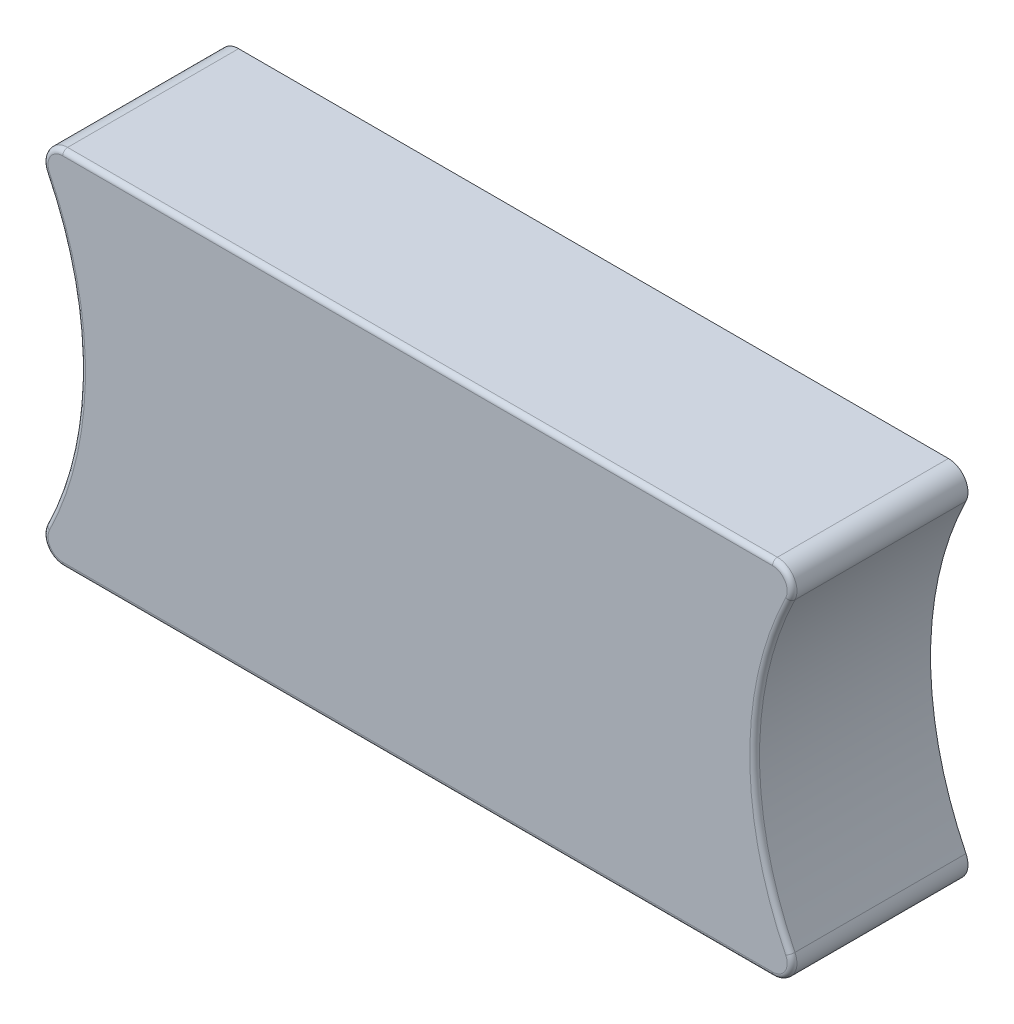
ISO-10303-21;
HEADER;
FILE_DESCRIPTION(('STEP AP214'),'2;1');
FILE_NAME('part.step','',(''),(''),'','','');
FILE_SCHEMA(('AUTOMOTIVE_DESIGN { 1 0 10303 214 1 1 1 1 }'));
ENDSEC;
DATA;
#1=APPLICATION_CONTEXT('core data for automotive mechanical design processes');
#2=APPLICATION_PROTOCOL_DEFINITION('international standard','automotive_design',2000,#1);
#3=PRODUCT_CONTEXT('',#1,'mechanical');
#4=PRODUCT('Part','Part','',(#3));
#5=PRODUCT_RELATED_PRODUCT_CATEGORY('part','',(#4));
#6=PRODUCT_DEFINITION_FORMATION('','',#4);
#7=PRODUCT_DEFINITION_CONTEXT('part definition',#1,'design');
#8=PRODUCT_DEFINITION('design','',#6,#7);
#9=PRODUCT_DEFINITION_SHAPE('','',#8);
#10=(LENGTH_UNIT() NAMED_UNIT(*) SI_UNIT(.MILLI.,.METRE.));
#11=(NAMED_UNIT(*) PLANE_ANGLE_UNIT() SI_UNIT($,.RADIAN.));
#12=(NAMED_UNIT(*) SI_UNIT($,.STERADIAN.) SOLID_ANGLE_UNIT());
#13=UNCERTAINTY_MEASURE_WITH_UNIT(LENGTH_MEASURE(1.E-05),#10,'distance_accuracy_value','');
#14=(GEOMETRIC_REPRESENTATION_CONTEXT(3) GLOBAL_UNCERTAINTY_ASSIGNED_CONTEXT((#13)) GLOBAL_UNIT_ASSIGNED_CONTEXT((#10,
#11,#12)) REPRESENTATION_CONTEXT('',''));
#15=CARTESIAN_POINT('',(0.,0.,0.));
#16=DIRECTION('',(0.,0.,1.));
#17=DIRECTION('',(1.,0.,0.));
#18=AXIS2_PLACEMENT_3D('',#15,#16,#17);
#19=CARTESIAN_POINT('',(72.6340015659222,37.,3.));
#20=DIRECTION('',(0.,-1.,0.));
#21=DIRECTION('',(0.,0.,-1.));
#22=AXIS2_PLACEMENT_3D('',#19,#20,#21);
#23=PLANE('',#22);
#24=DIRECTION('',(0.,0.,-1.));
#25=VECTOR('',#24,1.);
#26=CARTESIAN_POINT('',(-72.6340015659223,37.,3.));
#27=LINE('',#26,#25);
#28=CARTESIAN_POINT('',(-72.6340015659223,37.,2.));
#29=VERTEX_POINT('',#28);
#30=CARTESIAN_POINT('',(-72.6340015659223,37.,-33.));
#31=VERTEX_POINT('',#30);
#32=EDGE_CURVE('E289',#29,#31,#27,.T.);
#33=ORIENTED_EDGE('',*,*,#32,.F.);
#34=DIRECTION('',(-1.,0.,0.));
#35=VECTOR('',#34,1.);
#36=CARTESIAN_POINT('',(72.6340015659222,37.,2.));
#37=LINE('',#36,#35);
#38=CARTESIAN_POINT('',(72.6340015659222,37.,2.));
#39=VERTEX_POINT('',#38);
#40=EDGE_CURVE('E11',#29,#39,#37,.F.);
#41=ORIENTED_EDGE('',*,*,#40,.T.);
#42=DIRECTION('',(0.,0.,-1.));
#43=VECTOR('',#42,1.);
#44=CARTESIAN_POINT('',(72.6340015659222,37.,3.));
#45=LINE('',#44,#43);
#46=CARTESIAN_POINT('',(72.6340015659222,37.,-33.));
#47=VERTEX_POINT('',#46);
#48=EDGE_CURVE('E275',#39,#47,#45,.T.);
#49=ORIENTED_EDGE('',*,*,#48,.T.);
#50=DIRECTION('',(-1.,0.,0.));
#51=VECTOR('',#50,1.);
#52=CARTESIAN_POINT('',(72.6340015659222,37.,-33.));
#53=LINE('',#52,#51);
#54=EDGE_CURVE('E205',#47,#31,#53,.T.);
#55=ORIENTED_EDGE('',*,*,#54,.T.);
#56=EDGE_LOOP('',(#33,#41,#49,#55));
#57=FACE_BOUND('',#56,.T.);
#58=ADVANCED_FACE('F41',(#57),#23,.F.);
#59=CARTESIAN_POINT('',(-72.6340015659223,33.,3.));
#60=DIRECTION('',(0.,0.,-1.));
#61=DIRECTION('',(-1.,0.,0.));
#62=AXIS2_PLACEMENT_3D('',#59,#60,#61);
#63=CYLINDRICAL_SURFACE('',#62,3.99999999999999);
#64=DIRECTION('',(0.,0.,-1.));
#65=VECTOR('',#64,1.);
#66=CARTESIAN_POINT('',(-76.2253313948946,31.2386510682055,3.));
#67=LINE('',#66,#65);
#68=CARTESIAN_POINT('',(-76.2253313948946,31.2386510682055,2.));
#69=VERTEX_POINT('',#68);
#70=CARTESIAN_POINT('',(-76.2253313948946,31.2386510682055,-33.));
#71=VERTEX_POINT('',#70);
#72=EDGE_CURVE('E287',#69,#71,#67,.T.);
#73=ORIENTED_EDGE('',*,*,#72,.F.);
#74=CARTESIAN_POINT('',(-72.6340015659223,33.,2.));
#75=DIRECTION('',(0.,0.,1.));
#76=DIRECTION('',(1.,0.,0.));
#77=AXIS2_PLACEMENT_3D('',#74,#75,#76);
#78=CIRCLE('',#77,3.99999999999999);
#79=EDGE_CURVE('E50',#69,#29,#78,.F.);
#80=ORIENTED_EDGE('',*,*,#79,.T.);
#81=ORIENTED_EDGE('',*,*,#32,.T.);
#82=CARTESIAN_POINT('',(-72.6340015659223,33.,-33.));
#83=DIRECTION('',(0.,0.,1.));
#84=DIRECTION('',(1.,0.,0.));
#85=AXIS2_PLACEMENT_3D('',#82,#83,#84);
#86=CIRCLE('',#85,3.99999999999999);
#87=EDGE_CURVE('E209',#31,#71,#86,.T.);
#88=ORIENTED_EDGE('',*,*,#87,.T.);
#89=EDGE_LOOP('',(#73,#80,#81,#88));
#90=FACE_BOUND('',#89,.T.);
#91=ADVANCED_FACE('F410',(#90),#63,.T.);
#92=CARTESIAN_POINT('',(-139.919865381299,0.,3.));
#93=DIRECTION('',(0.,0.,-1.));
#94=DIRECTION('',(-1.,0.,0.));
#95=AXIS2_PLACEMENT_3D('',#92,#93,#94);
#96=CYLINDRICAL_SURFACE('',#95,70.942561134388);
#97=DIRECTION('',(0.,0.,-1.));
#98=VECTOR('',#97,1.);
#99=CARTESIAN_POINT('',(-76.2253313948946,-31.2386510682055,3.));
#100=LINE('',#99,#98);
#101=CARTESIAN_POINT('',(-76.2253313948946,-31.2386510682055,2.));
#102=VERTEX_POINT('',#101);
#103=CARTESIAN_POINT('',(-76.2253313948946,-31.2386510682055,-33.));
#104=VERTEX_POINT('',#103);
#105=EDGE_CURVE('E285',#102,#104,#100,.T.);
#106=ORIENTED_EDGE('',*,*,#105,.F.);
#107=CARTESIAN_POINT('',(-139.919865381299,0.,2.));
#108=DIRECTION('',(0.,0.,1.));
#109=DIRECTION('',(1.,0.,0.));
#110=AXIS2_PLACEMENT_3D('',#107,#108,#109);
#111=CIRCLE('',#110,70.942561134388);
#112=EDGE_CURVE('E65',#102,#69,#111,.T.);
#113=ORIENTED_EDGE('',*,*,#112,.T.);
#114=ORIENTED_EDGE('',*,*,#72,.T.);
#115=CARTESIAN_POINT('',(-139.919865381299,0.,-33.));
#116=DIRECTION('',(0.,0.,1.));
#117=DIRECTION('',(1.,0.,0.));
#118=AXIS2_PLACEMENT_3D('',#115,#116,#117);
#119=CIRCLE('',#118,70.942561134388);
#120=EDGE_CURVE('E257',#104,#71,#119,.T.);
#121=ORIENTED_EDGE('',*,*,#120,.F.);
#122=EDGE_LOOP('',(#106,#113,#114,#121));
#123=FACE_BOUND('',#122,.T.);
#124=ADVANCED_FACE('F355',(#123),#96,.F.);
#125=CARTESIAN_POINT('',(-72.6340015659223,-33.,3.));
#126=DIRECTION('',(0.,0.,-1.));
#127=DIRECTION('',(-1.,0.,0.));
#128=AXIS2_PLACEMENT_3D('',#125,#126,#127);
#129=CYLINDRICAL_SURFACE('',#128,3.99999999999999);
#130=DIRECTION('',(0.,0.,-1.));
#131=VECTOR('',#130,1.);
#132=CARTESIAN_POINT('',(-72.6340015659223,-37.,3.));
#133=LINE('',#132,#131);
#134=CARTESIAN_POINT('',(-72.6340015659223,-37.,2.));
#135=VERTEX_POINT('',#134);
#136=CARTESIAN_POINT('',(-72.6340015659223,-37.,-33.));
#137=VERTEX_POINT('',#136);
#138=EDGE_CURVE('E283',#135,#137,#133,.T.);
#139=ORIENTED_EDGE('',*,*,#138,.F.);
#140=CARTESIAN_POINT('',(-72.6340015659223,-33.,2.));
#141=DIRECTION('',(0.,0.,1.));
#142=DIRECTION('',(1.,0.,0.));
#143=AXIS2_PLACEMENT_3D('',#140,#141,#142);
#144=CIRCLE('',#143,3.99999999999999);
#145=EDGE_CURVE('E317',#135,#102,#144,.F.);
#146=ORIENTED_EDGE('',*,*,#145,.T.);
#147=ORIENTED_EDGE('',*,*,#105,.T.);
#148=CARTESIAN_POINT('',(-72.6340015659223,-33.,-33.));
#149=DIRECTION('',(0.,0.,1.));
#150=DIRECTION('',(1.,0.,0.));
#151=AXIS2_PLACEMENT_3D('',#148,#149,#150);
#152=CIRCLE('',#151,3.99999999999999);
#153=EDGE_CURVE('E260',#104,#137,#152,.T.);
#154=ORIENTED_EDGE('',*,*,#153,.T.);
#155=EDGE_LOOP('',(#139,#146,#147,#154));
#156=FACE_BOUND('',#155,.T.);
#157=ADVANCED_FACE('F353',(#156),#129,.T.);
#158=CARTESIAN_POINT('',(-72.6340015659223,-37.,3.));
#159=DIRECTION('',(0.,1.,0.));
#160=DIRECTION('',(0.,0.,1.));
#161=AXIS2_PLACEMENT_3D('',#158,#159,#160);
#162=PLANE('',#161);
#163=DIRECTION('',(0.,0.,-1.));
#164=VECTOR('',#163,1.);
#165=CARTESIAN_POINT('',(72.6340015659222,-37.,3.));
#166=LINE('',#165,#164);
#167=CARTESIAN_POINT('',(72.6340015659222,-37.,2.));
#168=VERTEX_POINT('',#167);
#169=CARTESIAN_POINT('',(72.6340015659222,-37.,-33.));
#170=VERTEX_POINT('',#169);
#171=EDGE_CURVE('E281',#168,#170,#166,.T.);
#172=ORIENTED_EDGE('',*,*,#171,.F.);
#173=DIRECTION('',(1.,0.,0.));
#174=VECTOR('',#173,1.);
#175=CARTESIAN_POINT('',(-72.6340015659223,-37.,2.));
#176=LINE('',#175,#174);
#177=EDGE_CURVE('E315',#168,#135,#176,.F.);
#178=ORIENTED_EDGE('',*,*,#177,.T.);
#179=ORIENTED_EDGE('',*,*,#138,.T.);
#180=DIRECTION('',(1.,0.,0.));
#181=VECTOR('',#180,1.);
#182=CARTESIAN_POINT('',(-72.6340015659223,-37.,-33.));
#183=LINE('',#182,#181);
#184=EDGE_CURVE('E263',#137,#170,#183,.T.);
#185=ORIENTED_EDGE('',*,*,#184,.T.);
#186=EDGE_LOOP('',(#172,#178,#179,#185));
#187=FACE_BOUND('',#186,.T.);
#188=ADVANCED_FACE('F365',(#187),#162,.F.);
#189=CARTESIAN_POINT('',(72.6340015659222,-33.,3.));
#190=DIRECTION('',(0.,0.,-1.));
#191=DIRECTION('',(-1.,0.,0.));
#192=AXIS2_PLACEMENT_3D('',#189,#190,#191);
#193=CYLINDRICAL_SURFACE('',#192,4.);
#194=DIRECTION('',(0.,0.,-1.));
#195=VECTOR('',#194,1.);
#196=CARTESIAN_POINT('',(76.2253313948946,-31.2386510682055,3.));
#197=LINE('',#196,#195);
#198=CARTESIAN_POINT('',(76.2253313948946,-31.2386510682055,2.));
#199=VERTEX_POINT('',#198);
#200=CARTESIAN_POINT('',(76.2253313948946,-31.2386510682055,-33.));
#201=VERTEX_POINT('',#200);
#202=EDGE_CURVE('E279',#199,#201,#197,.T.);
#203=ORIENTED_EDGE('',*,*,#202,.F.);
#204=CARTESIAN_POINT('',(72.6340015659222,-33.,2.));
#205=DIRECTION('',(0.,0.,1.));
#206=DIRECTION('',(1.,0.,0.));
#207=AXIS2_PLACEMENT_3D('',#204,#205,#206);
#208=CIRCLE('',#207,4.);
#209=EDGE_CURVE('E313',#199,#168,#208,.F.);
#210=ORIENTED_EDGE('',*,*,#209,.T.);
#211=ORIENTED_EDGE('',*,*,#171,.T.);
#212=CARTESIAN_POINT('',(72.6340015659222,-33.,-33.));
#213=DIRECTION('',(0.,0.,1.));
#214=DIRECTION('',(1.,0.,0.));
#215=AXIS2_PLACEMENT_3D('',#212,#213,#214);
#216=CIRCLE('',#215,4.);
#217=EDGE_CURVE('E266',#170,#201,#216,.T.);
#218=ORIENTED_EDGE('',*,*,#217,.T.);
#219=EDGE_LOOP('',(#203,#210,#211,#218));
#220=FACE_BOUND('',#219,.T.);
#221=ADVANCED_FACE('F368',(#220),#193,.T.);
#222=CARTESIAN_POINT('',(139.919865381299,0.,3.));
#223=DIRECTION('',(0.,0.,-1.));
#224=DIRECTION('',(-1.,0.,0.));
#225=AXIS2_PLACEMENT_3D('',#222,#223,#224);
#226=CYLINDRICAL_SURFACE('',#225,70.942561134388);
#227=DIRECTION('',(0.,0.,-1.));
#228=VECTOR('',#227,1.);
#229=CARTESIAN_POINT('',(76.2253313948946,31.2386510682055,3.));
#230=LINE('',#229,#228);
#231=CARTESIAN_POINT('',(76.2253313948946,31.2386510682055,2.));
#232=VERTEX_POINT('',#231);
#233=CARTESIAN_POINT('',(76.2253313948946,31.2386510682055,-33.));
#234=VERTEX_POINT('',#233);
#235=EDGE_CURVE('E277',#232,#234,#230,.T.);
#236=ORIENTED_EDGE('',*,*,#235,.F.);
#237=CARTESIAN_POINT('',(139.919865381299,0.,2.));
#238=DIRECTION('',(0.,0.,1.));
#239=DIRECTION('',(1.,0.,0.));
#240=AXIS2_PLACEMENT_3D('',#237,#238,#239);
#241=CIRCLE('',#240,70.942561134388);
#242=EDGE_CURVE('E311',#232,#199,#241,.T.);
#243=ORIENTED_EDGE('',*,*,#242,.T.);
#244=ORIENTED_EDGE('',*,*,#202,.T.);
#245=CARTESIAN_POINT('',(139.919865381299,0.,-33.));
#246=DIRECTION('',(0.,0.,1.));
#247=DIRECTION('',(1.,0.,0.));
#248=AXIS2_PLACEMENT_3D('',#245,#246,#247);
#249=CIRCLE('',#248,70.942561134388);
#250=EDGE_CURVE('E269',#234,#201,#249,.T.);
#251=ORIENTED_EDGE('',*,*,#250,.F.);
#252=EDGE_LOOP('',(#236,#243,#244,#251));
#253=FACE_BOUND('',#252,.T.);
#254=ADVANCED_FACE('F425',(#253),#226,.F.);
#255=CARTESIAN_POINT('',(72.6340015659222,33.,3.));
#256=DIRECTION('',(0.,0.,-1.));
#257=DIRECTION('',(-1.,0.,0.));
#258=AXIS2_PLACEMENT_3D('',#255,#256,#257);
#259=CYLINDRICAL_SURFACE('',#258,4.);
#260=ORIENTED_EDGE('',*,*,#48,.F.);
#261=CARTESIAN_POINT('',(72.6340015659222,33.,2.));
#262=DIRECTION('',(0.,0.,1.));
#263=DIRECTION('',(1.,0.,0.));
#264=AXIS2_PLACEMENT_3D('',#261,#262,#263);
#265=CIRCLE('',#264,4.);
#266=EDGE_CURVE('E308',#39,#232,#265,.F.);
#267=ORIENTED_EDGE('',*,*,#266,.T.);
#268=ORIENTED_EDGE('',*,*,#235,.T.);
#269=CARTESIAN_POINT('',(72.6340015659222,33.,-33.));
#270=DIRECTION('',(0.,0.,1.));
#271=DIRECTION('',(1.,0.,0.));
#272=AXIS2_PLACEMENT_3D('',#269,#270,#271);
#273=CIRCLE('',#272,4.);
#274=EDGE_CURVE('E272',#234,#47,#273,.T.);
#275=ORIENTED_EDGE('',*,*,#274,.T.);
#276=EDGE_LOOP('',(#260,#267,#268,#275));
#277=FACE_BOUND('',#276,.T.);
#278=ADVANCED_FACE('F397',(#277),#259,.T.);
#279=CARTESIAN_POINT('',(-72.6340015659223,33.,3.));
#280=DIRECTION('',(0.,0.,1.));
#281=DIRECTION('',(1.,0.,0.));
#282=AXIS2_PLACEMENT_3D('',#279,#280,#281);
#283=PLANE('',#282);
#284=CARTESIAN_POINT('',(139.919865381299,0.,3.));
#285=DIRECTION('',(0.,0.,1.));
#286=DIRECTION('',(1.,0.,0.));
#287=AXIS2_PLACEMENT_3D('',#284,#285,#286);
#288=CIRCLE('',#287,71.942561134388);
#289=CARTESIAN_POINT('',(75.3274989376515,-31.6789883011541,3.));
#290=VERTEX_POINT('',#289);
#291=CARTESIAN_POINT('',(75.3274989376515,31.6789883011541,3.));
#292=VERTEX_POINT('',#291);
#293=EDGE_CURVE('E303',#290,#292,#288,.F.);
#294=ORIENTED_EDGE('',*,*,#293,.T.);
#295=CARTESIAN_POINT('',(72.6340015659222,33.,3.));
#296=DIRECTION('',(0.,0.,1.));
#297=DIRECTION('',(1.,0.,0.));
#298=AXIS2_PLACEMENT_3D('',#295,#296,#297);
#299=CIRCLE('',#298,3.);
#300=CARTESIAN_POINT('',(72.6340015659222,36.,3.));
#301=VERTEX_POINT('',#300);
#302=EDGE_CURVE('E305',#292,#301,#299,.T.);
#303=ORIENTED_EDGE('',*,*,#302,.T.);
#304=DIRECTION('',(-1.,0.,0.));
#305=VECTOR('',#304,1.);
#306=CARTESIAN_POINT('',(-72.6340015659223,36.,3.));
#307=LINE('',#306,#305);
#308=CARTESIAN_POINT('',(-72.6340015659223,36.,3.));
#309=VERTEX_POINT('',#308);
#310=EDGE_CURVE('E291',#301,#309,#307,.T.);
#311=ORIENTED_EDGE('',*,*,#310,.T.);
#312=CARTESIAN_POINT('',(-72.6340015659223,33.,3.));
#313=DIRECTION('',(0.,0.,1.));
#314=DIRECTION('',(1.,0.,0.));
#315=AXIS2_PLACEMENT_3D('',#312,#313,#314);
#316=CIRCLE('',#315,2.99999999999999);
#317=CARTESIAN_POINT('',(-75.3274989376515,31.6789883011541,3.));
#318=VERTEX_POINT('',#317);
#319=EDGE_CURVE('E293',#309,#318,#316,.T.);
#320=ORIENTED_EDGE('',*,*,#319,.T.);
#321=CARTESIAN_POINT('',(-139.919865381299,0.,3.));
#322=DIRECTION('',(0.,0.,1.));
#323=DIRECTION('',(1.,0.,0.));
#324=AXIS2_PLACEMENT_3D('',#321,#322,#323);
#325=CIRCLE('',#324,71.942561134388);
#326=CARTESIAN_POINT('',(-75.3274989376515,-31.6789883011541,3.));
#327=VERTEX_POINT('',#326);
#328=EDGE_CURVE('E295',#318,#327,#325,.F.);
#329=ORIENTED_EDGE('',*,*,#328,.T.);
#330=CARTESIAN_POINT('',(-72.6340015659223,-33.,3.));
#331=DIRECTION('',(0.,0.,1.));
#332=DIRECTION('',(1.,0.,0.));
#333=AXIS2_PLACEMENT_3D('',#330,#331,#332);
#334=CIRCLE('',#333,2.99999999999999);
#335=CARTESIAN_POINT('',(-72.6340015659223,-36.,3.));
#336=VERTEX_POINT('',#335);
#337=EDGE_CURVE('E297',#327,#336,#334,.T.);
#338=ORIENTED_EDGE('',*,*,#337,.T.);
#339=DIRECTION('',(1.,0.,0.));
#340=VECTOR('',#339,1.);
#341=CARTESIAN_POINT('',(72.6340015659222,-36.,3.));
#342=LINE('',#341,#340);
#343=CARTESIAN_POINT('',(72.6340015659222,-36.,3.));
#344=VERTEX_POINT('',#343);
#345=EDGE_CURVE('E299',#336,#344,#342,.T.);
#346=ORIENTED_EDGE('',*,*,#345,.T.);
#347=CARTESIAN_POINT('',(72.6340015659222,-33.,3.));
#348=DIRECTION('',(0.,0.,1.));
#349=DIRECTION('',(1.,0.,0.));
#350=AXIS2_PLACEMENT_3D('',#347,#348,#349);
#351=CIRCLE('',#350,3.);
#352=EDGE_CURVE('E301',#344,#290,#351,.T.);
#353=ORIENTED_EDGE('',*,*,#352,.T.);
#354=EDGE_LOOP('',(#294,#303,#311,#320,#329,#338,#346,#353));
#355=FACE_BOUND('',#354,.T.);
#356=ADVANCED_FACE('F381',(#355),#283,.T.);
#357=CARTESIAN_POINT('',(-72.6340015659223,33.,-33.));
#358=DIRECTION('',(0.,0.,1.));
#359=DIRECTION('',(1.,0.,0.));
#360=AXIS2_PLACEMENT_3D('',#357,#358,#359);
#361=PLANE('',#360);
#362=CARTESIAN_POINT('',(72.6340015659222,33.,-33.));
#363=DIRECTION('',(0.,0.,1.));
#364=DIRECTION('',(1.,0.,0.));
#365=AXIS2_PLACEMENT_3D('',#362,#363,#364);
#366=CIRCLE('',#365,1.);
#367=CARTESIAN_POINT('',(73.5318340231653,32.5596627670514,-33.));
#368=VERTEX_POINT('',#367);
#369=CARTESIAN_POINT('',(72.6340015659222,34.,-33.));
#370=VERTEX_POINT('',#369);
#371=EDGE_CURVE('E199',#368,#370,#366,.T.);
#372=ORIENTED_EDGE('',*,*,#371,.T.);
#373=DIRECTION('',(-1.,0.,0.));
#374=VECTOR('',#373,1.);
#375=CARTESIAN_POINT('',(72.6340015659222,34.,-33.));
#376=LINE('',#375,#374);
#377=CARTESIAN_POINT('',(-72.6340015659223,34.,-33.));
#378=VERTEX_POINT('',#377);
#379=EDGE_CURVE('E236',#370,#378,#376,.T.);
#380=ORIENTED_EDGE('',*,*,#379,.T.);
#381=CARTESIAN_POINT('',(-72.6340015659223,33.,-33.));
#382=DIRECTION('',(0.,0.,1.));
#383=DIRECTION('',(1.,0.,0.));
#384=AXIS2_PLACEMENT_3D('',#381,#382,#383);
#385=CIRCLE('',#384,0.999999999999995);
#386=CARTESIAN_POINT('',(-73.5318340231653,32.5596627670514,-33.));
#387=VERTEX_POINT('',#386);
#388=EDGE_CURVE('E203',#378,#387,#385,.T.);
#389=ORIENTED_EDGE('',*,*,#388,.T.);
#390=CARTESIAN_POINT('',(-139.919865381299,0.,-33.));
#391=DIRECTION('',(0.,0.,1.));
#392=DIRECTION('',(1.,0.,0.));
#393=AXIS2_PLACEMENT_3D('',#390,#391,#392);
#394=CIRCLE('',#393,73.942561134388);
#395=CARTESIAN_POINT('',(-73.5318340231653,-32.5596627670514,-33.));
#396=VERTEX_POINT('',#395);
#397=EDGE_CURVE('E252',#396,#387,#394,.T.);
#398=ORIENTED_EDGE('',*,*,#397,.F.);
#399=CARTESIAN_POINT('',(-72.6340015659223,-33.,-33.));
#400=DIRECTION('',(0.,0.,1.));
#401=DIRECTION('',(1.,0.,0.));
#402=AXIS2_PLACEMENT_3D('',#399,#400,#401);
#403=CIRCLE('',#402,0.999999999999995);
#404=CARTESIAN_POINT('',(-72.6340015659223,-34.,-33.));
#405=VERTEX_POINT('',#404);
#406=EDGE_CURVE('E249',#396,#405,#403,.T.);
#407=ORIENTED_EDGE('',*,*,#406,.T.);
#408=DIRECTION('',(1.,0.,0.));
#409=VECTOR('',#408,1.);
#410=CARTESIAN_POINT('',(-72.6340015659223,-34.,-33.));
#411=LINE('',#410,#409);
#412=CARTESIAN_POINT('',(72.6340015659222,-34.,-33.));
#413=VERTEX_POINT('',#412);
#414=EDGE_CURVE('E246',#405,#413,#411,.T.);
#415=ORIENTED_EDGE('',*,*,#414,.T.);
#416=CARTESIAN_POINT('',(72.6340015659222,-33.,-33.));
#417=DIRECTION('',(0.,0.,1.));
#418=DIRECTION('',(1.,0.,0.));
#419=AXIS2_PLACEMENT_3D('',#416,#417,#418);
#420=CIRCLE('',#419,0.999999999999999);
#421=CARTESIAN_POINT('',(73.5318340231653,-32.5596627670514,-33.));
#422=VERTEX_POINT('',#421);
#423=EDGE_CURVE('E243',#413,#422,#420,.T.);
#424=ORIENTED_EDGE('',*,*,#423,.T.);
#425=CARTESIAN_POINT('',(139.919865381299,0.,-33.));
#426=DIRECTION('',(0.,0.,1.));
#427=DIRECTION('',(1.,0.,0.));
#428=AXIS2_PLACEMENT_3D('',#425,#426,#427);
#429=CIRCLE('',#428,73.942561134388);
#430=EDGE_CURVE('E240',#368,#422,#429,.T.);
#431=ORIENTED_EDGE('',*,*,#430,.F.);
#432=EDGE_LOOP('',(#372,#380,#389,#398,#407,#415,#424,#431));
#433=FACE_BOUND('',#432,.T.);
#434=ORIENTED_EDGE('',*,*,#54,.F.);
#435=ORIENTED_EDGE('',*,*,#274,.F.);
#436=ORIENTED_EDGE('',*,*,#250,.T.);
#437=ORIENTED_EDGE('',*,*,#217,.F.);
#438=ORIENTED_EDGE('',*,*,#184,.F.);
#439=ORIENTED_EDGE('',*,*,#153,.F.);
#440=ORIENTED_EDGE('',*,*,#120,.T.);
#441=ORIENTED_EDGE('',*,*,#87,.F.);
#442=EDGE_LOOP('',(#434,#435,#436,#437,#438,#439,#440,#441));
#443=FACE_BOUND('',#442,.T.);
#444=ADVANCED_FACE('F361',(#433,#443),#361,.F.);
#445=CARTESIAN_POINT('',(72.6340015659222,34.,3.));
#446=DIRECTION('',(0.,-1.,0.));
#447=DIRECTION('',(0.,0.,-1.));
#448=AXIS2_PLACEMENT_3D('',#445,#446,#447);
#449=PLANE('',#448);
#450=DIRECTION('',(0.,0.,-1.));
#451=VECTOR('',#450,1.);
#452=CARTESIAN_POINT('',(72.6340015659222,34.,3.));
#453=LINE('',#452,#451);
#454=CARTESIAN_POINT('',(72.6340015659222,34.,0.));
#455=VERTEX_POINT('',#454);
#456=EDGE_CURVE('E198',#455,#370,#453,.T.);
#457=ORIENTED_EDGE('',*,*,#456,.F.);
#458=DIRECTION('',(-1.,0.,0.));
#459=VECTOR('',#458,1.);
#460=CARTESIAN_POINT('',(72.6340015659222,34.,0.));
#461=LINE('',#460,#459);
#462=CARTESIAN_POINT('',(-72.6340015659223,34.,0.));
#463=VERTEX_POINT('',#462);
#464=EDGE_CURVE('E183',#455,#463,#461,.T.);
#465=ORIENTED_EDGE('',*,*,#464,.T.);
#466=DIRECTION('',(0.,0.,-1.));
#467=VECTOR('',#466,1.);
#468=CARTESIAN_POINT('',(-72.6340015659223,34.,3.));
#469=LINE('',#468,#467);
#470=EDGE_CURVE('E196',#463,#378,#469,.T.);
#471=ORIENTED_EDGE('',*,*,#470,.T.);
#472=ORIENTED_EDGE('',*,*,#379,.F.);
#473=EDGE_LOOP('',(#457,#465,#471,#472));
#474=FACE_BOUND('',#473,.T.);
#475=ADVANCED_FACE('F194',(#474),#449,.T.);
#476=CARTESIAN_POINT('',(-72.6340015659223,33.,3.));
#477=DIRECTION('',(0.,0.,-1.));
#478=DIRECTION('',(-1.,0.,0.));
#479=AXIS2_PLACEMENT_3D('',#476,#477,#478);
#480=CYLINDRICAL_SURFACE('',#479,0.999999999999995);
#481=ORIENTED_EDGE('',*,*,#470,.F.);
#482=CARTESIAN_POINT('',(-72.6340015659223,33.,0.));
#483=DIRECTION('',(0.,0.,1.));
#484=DIRECTION('',(1.,0.,0.));
#485=AXIS2_PLACEMENT_3D('',#482,#483,#484);
#486=CIRCLE('',#485,0.999999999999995);
#487=CARTESIAN_POINT('',(-73.5318340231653,32.5596627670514,0.));
#488=VERTEX_POINT('',#487);
#489=EDGE_CURVE('E179',#463,#488,#486,.T.);
#490=ORIENTED_EDGE('',*,*,#489,.T.);
#491=DIRECTION('',(0.,0.,-1.));
#492=VECTOR('',#491,1.);
#493=CARTESIAN_POINT('',(-73.5318340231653,32.5596627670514,3.));
#494=LINE('',#493,#492);
#495=EDGE_CURVE('E206',#488,#387,#494,.T.);
#496=ORIENTED_EDGE('',*,*,#495,.T.);
#497=ORIENTED_EDGE('',*,*,#388,.F.);
#498=EDGE_LOOP('',(#481,#490,#496,#497));
#499=FACE_BOUND('',#498,.T.);
#500=ADVANCED_FACE('F201',(#499),#480,.F.);
#501=CARTESIAN_POINT('',(-139.919865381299,0.,3.));
#502=DIRECTION('',(0.,0.,-1.));
#503=DIRECTION('',(-1.,0.,0.));
#504=AXIS2_PLACEMENT_3D('',#501,#502,#503);
#505=CYLINDRICAL_SURFACE('',#504,73.942561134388);
#506=ORIENTED_EDGE('',*,*,#495,.F.);
#507=CARTESIAN_POINT('',(-139.919865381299,0.,0.));
#508=DIRECTION('',(0.,0.,1.));
#509=DIRECTION('',(1.,0.,0.));
#510=AXIS2_PLACEMENT_3D('',#507,#508,#509);
#511=CIRCLE('',#510,73.942561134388);
#512=CARTESIAN_POINT('',(-73.5318340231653,-32.5596627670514,0.));
#513=VERTEX_POINT('',#512);
#514=EDGE_CURVE('E186',#513,#488,#511,.T.);
#515=ORIENTED_EDGE('',*,*,#514,.F.);
#516=DIRECTION('',(0.,0.,-1.));
#517=VECTOR('',#516,1.);
#518=CARTESIAN_POINT('',(-73.5318340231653,-32.5596627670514,3.));
#519=LINE('',#518,#517);
#520=EDGE_CURVE('E211',#513,#396,#519,.T.);
#521=ORIENTED_EDGE('',*,*,#520,.T.);
#522=ORIENTED_EDGE('',*,*,#397,.T.);
#523=EDGE_LOOP('',(#506,#515,#521,#522));
#524=FACE_BOUND('',#523,.T.);
#525=ADVANCED_FACE('F457',(#524),#505,.T.);
#526=CARTESIAN_POINT('',(-72.6340015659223,-33.,3.));
#527=DIRECTION('',(0.,0.,-1.));
#528=DIRECTION('',(-1.,0.,0.));
#529=AXIS2_PLACEMENT_3D('',#526,#527,#528);
#530=CYLINDRICAL_SURFACE('',#529,0.999999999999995);
#531=ORIENTED_EDGE('',*,*,#520,.F.);
#532=CARTESIAN_POINT('',(-72.6340015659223,-33.,0.));
#533=DIRECTION('',(0.,0.,1.));
#534=DIRECTION('',(1.,0.,0.));
#535=AXIS2_PLACEMENT_3D('',#532,#533,#534);
#536=CIRCLE('',#535,0.999999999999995);
#537=CARTESIAN_POINT('',(-72.6340015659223,-34.,0.));
#538=VERTEX_POINT('',#537);
#539=EDGE_CURVE('E218',#513,#538,#536,.T.);
#540=ORIENTED_EDGE('',*,*,#539,.T.);
#541=DIRECTION('',(0.,0.,1.));
#542=VECTOR('',#541,1.);
#543=CARTESIAN_POINT('',(-72.6340015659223,-34.,3.));
#544=LINE('',#543,#542);
#545=EDGE_CURVE('E216',#538,#405,#544,.F.);
#546=ORIENTED_EDGE('',*,*,#545,.T.);
#547=ORIENTED_EDGE('',*,*,#406,.F.);
#548=EDGE_LOOP('',(#531,#540,#546,#547));
#549=FACE_BOUND('',#548,.T.);
#550=ADVANCED_FACE('F453',(#549),#530,.F.);
#551=CARTESIAN_POINT('',(-72.6340015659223,-34.,3.));
#552=DIRECTION('',(0.,1.,0.));
#553=DIRECTION('',(0.,0.,1.));
#554=AXIS2_PLACEMENT_3D('',#551,#552,#553);
#555=PLANE('',#554);
#556=ORIENTED_EDGE('',*,*,#545,.F.);
#557=DIRECTION('',(1.,0.,0.));
#558=VECTOR('',#557,1.);
#559=CARTESIAN_POINT('',(-72.6340015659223,-34.,0.));
#560=LINE('',#559,#558);
#561=CARTESIAN_POINT('',(72.6340015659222,-34.,0.));
#562=VERTEX_POINT('',#561);
#563=EDGE_CURVE('E222',#538,#562,#560,.T.);
#564=ORIENTED_EDGE('',*,*,#563,.T.);
#565=DIRECTION('',(0.,0.,-1.));
#566=VECTOR('',#565,1.);
#567=CARTESIAN_POINT('',(72.6340015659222,-34.,3.));
#568=LINE('',#567,#566);
#569=EDGE_CURVE('E220',#562,#413,#568,.T.);
#570=ORIENTED_EDGE('',*,*,#569,.T.);
#571=ORIENTED_EDGE('',*,*,#414,.F.);
#572=EDGE_LOOP('',(#556,#564,#570,#571));
#573=FACE_BOUND('',#572,.T.);
#574=ADVANCED_FACE('F449',(#573),#555,.T.);
#575=CARTESIAN_POINT('',(72.6340015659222,-33.,3.));
#576=DIRECTION('',(0.,0.,-1.));
#577=DIRECTION('',(-1.,0.,0.));
#578=AXIS2_PLACEMENT_3D('',#575,#576,#577);
#579=CYLINDRICAL_SURFACE('',#578,0.999999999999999);
#580=ORIENTED_EDGE('',*,*,#569,.F.);
#581=CARTESIAN_POINT('',(72.6340015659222,-33.,0.));
#582=DIRECTION('',(0.,0.,1.));
#583=DIRECTION('',(1.,0.,0.));
#584=AXIS2_PLACEMENT_3D('',#581,#582,#583);
#585=CIRCLE('',#584,0.999999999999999);
#586=CARTESIAN_POINT('',(73.5318340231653,-32.5596627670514,0.));
#587=VERTEX_POINT('',#586);
#588=EDGE_CURVE('E226',#562,#587,#585,.T.);
#589=ORIENTED_EDGE('',*,*,#588,.T.);
#590=DIRECTION('',(0.,0.,-1.));
#591=VECTOR('',#590,1.);
#592=CARTESIAN_POINT('',(73.5318340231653,-32.5596627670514,3.));
#593=LINE('',#592,#591);
#594=EDGE_CURVE('E224',#587,#422,#593,.T.);
#595=ORIENTED_EDGE('',*,*,#594,.T.);
#596=ORIENTED_EDGE('',*,*,#423,.F.);
#597=EDGE_LOOP('',(#580,#589,#595,#596));
#598=FACE_BOUND('',#597,.T.);
#599=ADVANCED_FACE('F445',(#598),#579,.F.);
#600=CARTESIAN_POINT('',(139.919865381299,0.,3.));
#601=DIRECTION('',(0.,0.,-1.));
#602=DIRECTION('',(-1.,0.,0.));
#603=AXIS2_PLACEMENT_3D('',#600,#601,#602);
#604=CYLINDRICAL_SURFACE('',#603,73.942561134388);
#605=ORIENTED_EDGE('',*,*,#594,.F.);
#606=CARTESIAN_POINT('',(139.919865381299,0.,0.));
#607=DIRECTION('',(0.,0.,1.));
#608=DIRECTION('',(1.,0.,0.));
#609=AXIS2_PLACEMENT_3D('',#606,#607,#608);
#610=CIRCLE('',#609,73.942561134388);
#611=CARTESIAN_POINT('',(73.5318340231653,32.5596627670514,0.));
#612=VERTEX_POINT('',#611);
#613=EDGE_CURVE('E230',#612,#587,#610,.T.);
#614=ORIENTED_EDGE('',*,*,#613,.F.);
#615=DIRECTION('',(0.,0.,-1.));
#616=VECTOR('',#615,1.);
#617=CARTESIAN_POINT('',(73.5318340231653,32.5596627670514,3.));
#618=LINE('',#617,#616);
#619=EDGE_CURVE('E228',#612,#368,#618,.T.);
#620=ORIENTED_EDGE('',*,*,#619,.T.);
#621=ORIENTED_EDGE('',*,*,#430,.T.);
#622=EDGE_LOOP('',(#605,#614,#620,#621));
#623=FACE_BOUND('',#622,.T.);
#624=ADVANCED_FACE('F441',(#623),#604,.T.);
#625=CARTESIAN_POINT('',(72.6340015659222,33.,3.));
#626=DIRECTION('',(0.,0.,-1.));
#627=DIRECTION('',(-1.,0.,0.));
#628=AXIS2_PLACEMENT_3D('',#625,#626,#627);
#629=CYLINDRICAL_SURFACE('',#628,1.);
#630=ORIENTED_EDGE('',*,*,#619,.F.);
#631=CARTESIAN_POINT('',(72.6340015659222,33.,0.));
#632=DIRECTION('',(0.,0.,1.));
#633=DIRECTION('',(1.,0.,0.));
#634=AXIS2_PLACEMENT_3D('',#631,#632,#633);
#635=CIRCLE('',#634,1.);
#636=EDGE_CURVE('E234',#612,#455,#635,.T.);
#637=ORIENTED_EDGE('',*,*,#636,.T.);
#638=ORIENTED_EDGE('',*,*,#456,.T.);
#639=ORIENTED_EDGE('',*,*,#371,.F.);
#640=EDGE_LOOP('',(#630,#637,#638,#639));
#641=FACE_BOUND('',#640,.T.);
#642=ADVANCED_FACE('F438',(#641),#629,.F.);
#643=CARTESIAN_POINT('',(-72.6340015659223,33.,0.));
#644=DIRECTION('',(0.,0.,1.));
#645=DIRECTION('',(1.,0.,0.));
#646=AXIS2_PLACEMENT_3D('',#643,#644,#645);
#647=PLANE('',#646);
#648=ORIENTED_EDGE('',*,*,#464,.F.);
#649=ORIENTED_EDGE('',*,*,#636,.F.);
#650=ORIENTED_EDGE('',*,*,#613,.T.);
#651=ORIENTED_EDGE('',*,*,#588,.F.);
#652=ORIENTED_EDGE('',*,*,#563,.F.);
#653=ORIENTED_EDGE('',*,*,#539,.F.);
#654=ORIENTED_EDGE('',*,*,#514,.T.);
#655=ORIENTED_EDGE('',*,*,#489,.F.);
#656=EDGE_LOOP('',(#648,#649,#650,#651,#652,#653,#654,#655));
#657=FACE_BOUND('',#656,.T.);
#658=ADVANCED_FACE('F181',(#657),#647,.F.);
#659=CARTESIAN_POINT('',(-72.6340015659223,-33.,2.));
#660=DIRECTION('',(0.,0.,1.));
#661=DIRECTION('',(1.,0.,0.));
#662=AXIS2_PLACEMENT_3D('',#659,#660,#661);
#663=TOROIDAL_SURFACE('',#662,2.99999999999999,1.);
#664=CARTESIAN_POINT('',(-75.3274989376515,-31.6789883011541,2.));
#665=DIRECTION('',(0.44033723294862,0.897832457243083,0.));
#666=DIRECTION('',(-0.897832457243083,0.44033723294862,0.));
#667=AXIS2_PLACEMENT_3D('',#664,#665,#666);
#668=CIRCLE('',#667,1.);
#669=EDGE_CURVE('E336',#102,#327,#668,.T.);
#670=ORIENTED_EDGE('',*,*,#669,.F.);
#671=ORIENTED_EDGE('',*,*,#145,.F.);
#672=CARTESIAN_POINT('',(-72.6340015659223,-36.,2.));
#673=DIRECTION('',(1.,0.,0.));
#674=DIRECTION('',(0.,0.,-1.));
#675=AXIS2_PLACEMENT_3D('',#672,#673,#674);
#676=CIRCLE('',#675,1.);
#677=EDGE_CURVE('E45',#336,#135,#676,.T.);
#678=ORIENTED_EDGE('',*,*,#677,.F.);
#679=ORIENTED_EDGE('',*,*,#337,.F.);
#680=EDGE_LOOP('',(#670,#671,#678,#679));
#681=FACE_BOUND('',#680,.T.);
#682=ADVANCED_FACE('F43',(#681),#663,.T.);
#683=CARTESIAN_POINT('',(-72.6340015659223,-36.,2.));
#684=DIRECTION('',(-1.,0.,0.));
#685=DIRECTION('',(0.,0.,1.));
#686=AXIS2_PLACEMENT_3D('',#683,#684,#685);
#687=CYLINDRICAL_SURFACE('',#686,1.);
#688=ORIENTED_EDGE('',*,*,#677,.T.);
#689=ORIENTED_EDGE('',*,*,#177,.F.);
#690=CARTESIAN_POINT('',(72.6340015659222,-36.,2.));
#691=DIRECTION('',(1.,0.,0.));
#692=DIRECTION('',(0.,0.,-1.));
#693=AXIS2_PLACEMENT_3D('',#690,#691,#692);
#694=CIRCLE('',#693,1.);
#695=EDGE_CURVE('E334',#344,#168,#694,.T.);
#696=ORIENTED_EDGE('',*,*,#695,.F.);
#697=ORIENTED_EDGE('',*,*,#345,.F.);
#698=EDGE_LOOP('',(#688,#689,#696,#697));
#699=FACE_BOUND('',#698,.T.);
#700=ADVANCED_FACE('F346',(#699),#687,.T.);
#701=CARTESIAN_POINT('',(-139.919865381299,0.,2.));
#702=DIRECTION('',(0.,0.,1.));
#703=DIRECTION('',(1.,0.,0.));
#704=AXIS2_PLACEMENT_3D('',#701,#702,#703);
#705=TOROIDAL_SURFACE('',#704,71.942561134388,1.);
#706=ORIENTED_EDGE('',*,*,#669,.T.);
#707=ORIENTED_EDGE('',*,*,#328,.F.);
#708=CARTESIAN_POINT('',(-75.3274989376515,31.6789883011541,2.));
#709=DIRECTION('',(-0.440337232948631,0.897832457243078,0.));
#710=DIRECTION('',(-0.897832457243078,-0.440337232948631,0.));
#711=AXIS2_PLACEMENT_3D('',#708,#709,#710);
#712=CIRCLE('',#711,1.);
#713=EDGE_CURVE('E331',#69,#318,#712,.T.);
#714=ORIENTED_EDGE('',*,*,#713,.F.);
#715=ORIENTED_EDGE('',*,*,#112,.F.);
#716=EDGE_LOOP('',(#706,#707,#714,#715));
#717=FACE_BOUND('',#716,.T.);
#718=ADVANCED_FACE('F384',(#717),#705,.T.);
#719=CARTESIAN_POINT('',(72.6340015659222,-33.,2.));
#720=DIRECTION('',(0.,0.,1.));
#721=DIRECTION('',(1.,0.,0.));
#722=AXIS2_PLACEMENT_3D('',#719,#720,#721);
#723=TOROIDAL_SURFACE('',#722,3.,1.);
#724=ORIENTED_EDGE('',*,*,#695,.T.);
#725=ORIENTED_EDGE('',*,*,#209,.F.);
#726=CARTESIAN_POINT('',(75.3274989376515,-31.6789883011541,2.));
#727=DIRECTION('',(-0.440337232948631,0.897832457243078,0.));
#728=DIRECTION('',(-0.897832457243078,-0.440337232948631,0.));
#729=AXIS2_PLACEMENT_3D('',#726,#727,#728);
#730=CIRCLE('',#729,1.);
#731=EDGE_CURVE('E328',#290,#199,#730,.T.);
#732=ORIENTED_EDGE('',*,*,#731,.F.);
#733=ORIENTED_EDGE('',*,*,#352,.F.);
#734=EDGE_LOOP('',(#724,#725,#732,#733));
#735=FACE_BOUND('',#734,.T.);
#736=ADVANCED_FACE('F372',(#735),#723,.T.);
#737=CARTESIAN_POINT('',(-72.6340015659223,33.,2.));
#738=DIRECTION('',(0.,0.,1.));
#739=DIRECTION('',(1.,0.,0.));
#740=AXIS2_PLACEMENT_3D('',#737,#738,#739);
#741=TOROIDAL_SURFACE('',#740,2.99999999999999,1.);
#742=ORIENTED_EDGE('',*,*,#713,.T.);
#743=ORIENTED_EDGE('',*,*,#319,.F.);
#744=CARTESIAN_POINT('',(-72.6340015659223,36.,2.));
#745=DIRECTION('',(1.,0.,0.));
#746=DIRECTION('',(0.,0.,-1.));
#747=AXIS2_PLACEMENT_3D('',#744,#745,#746);
#748=CIRCLE('',#747,1.);
#749=EDGE_CURVE('E325',#29,#309,#748,.T.);
#750=ORIENTED_EDGE('',*,*,#749,.F.);
#751=ORIENTED_EDGE('',*,*,#79,.F.);
#752=EDGE_LOOP('',(#742,#743,#750,#751));
#753=FACE_BOUND('',#752,.T.);
#754=ADVANCED_FACE('F386',(#753),#741,.T.);
#755=CARTESIAN_POINT('',(139.919865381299,0.,2.));
#756=DIRECTION('',(0.,0.,1.));
#757=DIRECTION('',(1.,0.,0.));
#758=AXIS2_PLACEMENT_3D('',#755,#756,#757);
#759=TOROIDAL_SURFACE('',#758,71.942561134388,1.);
#760=ORIENTED_EDGE('',*,*,#731,.T.);
#761=ORIENTED_EDGE('',*,*,#242,.F.);
#762=CARTESIAN_POINT('',(75.3274989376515,31.6789883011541,2.));
#763=DIRECTION('',(0.440337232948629,0.897832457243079,0.));
#764=DIRECTION('',(-0.897832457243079,0.440337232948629,0.));
#765=AXIS2_PLACEMENT_3D('',#762,#763,#764);
#766=CIRCLE('',#765,1.);
#767=EDGE_CURVE('E323',#292,#232,#766,.T.);
#768=ORIENTED_EDGE('',*,*,#767,.F.);
#769=ORIENTED_EDGE('',*,*,#293,.F.);
#770=EDGE_LOOP('',(#760,#761,#768,#769));
#771=FACE_BOUND('',#770,.T.);
#772=ADVANCED_FACE('F377',(#771),#759,.T.);
#773=CARTESIAN_POINT('',(-72.6340015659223,36.,2.));
#774=DIRECTION('',(1.,0.,0.));
#775=DIRECTION('',(0.,0.,-1.));
#776=AXIS2_PLACEMENT_3D('',#773,#774,#775);
#777=CYLINDRICAL_SURFACE('',#776,1.);
#778=ORIENTED_EDGE('',*,*,#749,.T.);
#779=ORIENTED_EDGE('',*,*,#310,.F.);
#780=CARTESIAN_POINT('',(72.6340015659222,36.,2.));
#781=DIRECTION('',(1.,0.,0.));
#782=DIRECTION('',(0.,0.,-1.));
#783=AXIS2_PLACEMENT_3D('',#780,#781,#782);
#784=CIRCLE('',#783,1.);
#785=EDGE_CURVE('E321',#39,#301,#784,.T.);
#786=ORIENTED_EDGE('',*,*,#785,.F.);
#787=ORIENTED_EDGE('',*,*,#40,.F.);
#788=EDGE_LOOP('',(#778,#779,#786,#787));
#789=FACE_BOUND('',#788,.T.);
#790=ADVANCED_FACE('F392',(#789),#777,.T.);
#791=CARTESIAN_POINT('',(72.6340015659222,33.,2.));
#792=DIRECTION('',(0.,0.,1.));
#793=DIRECTION('',(1.,0.,0.));
#794=AXIS2_PLACEMENT_3D('',#791,#792,#793);
#795=TOROIDAL_SURFACE('',#794,3.,1.);
#796=ORIENTED_EDGE('',*,*,#767,.T.);
#797=ORIENTED_EDGE('',*,*,#266,.F.);
#798=ORIENTED_EDGE('',*,*,#785,.T.);
#799=ORIENTED_EDGE('',*,*,#302,.F.);
#800=EDGE_LOOP('',(#796,#797,#798,#799));
#801=FACE_BOUND('',#800,.T.);
#802=ADVANCED_FACE('F401',(#801),#795,.T.);
#803=CLOSED_SHELL('',(#58,#91,#124,#157,#188,#221,#254,#278,#356,#444,#475,#500,#525,#550,#574,
#599,#624,#642,#658,#682,#700,#718,#736,#754,#772,#790,#802));
#804=MANIFOLD_SOLID_BREP('B2',#803);
#805=ADVANCED_BREP_SHAPE_REPRESENTATION('',(#18,#804),#14);
#806=SHAPE_DEFINITION_REPRESENTATION(#9,#805);
ENDSEC;
END-ISO-10303-21;
